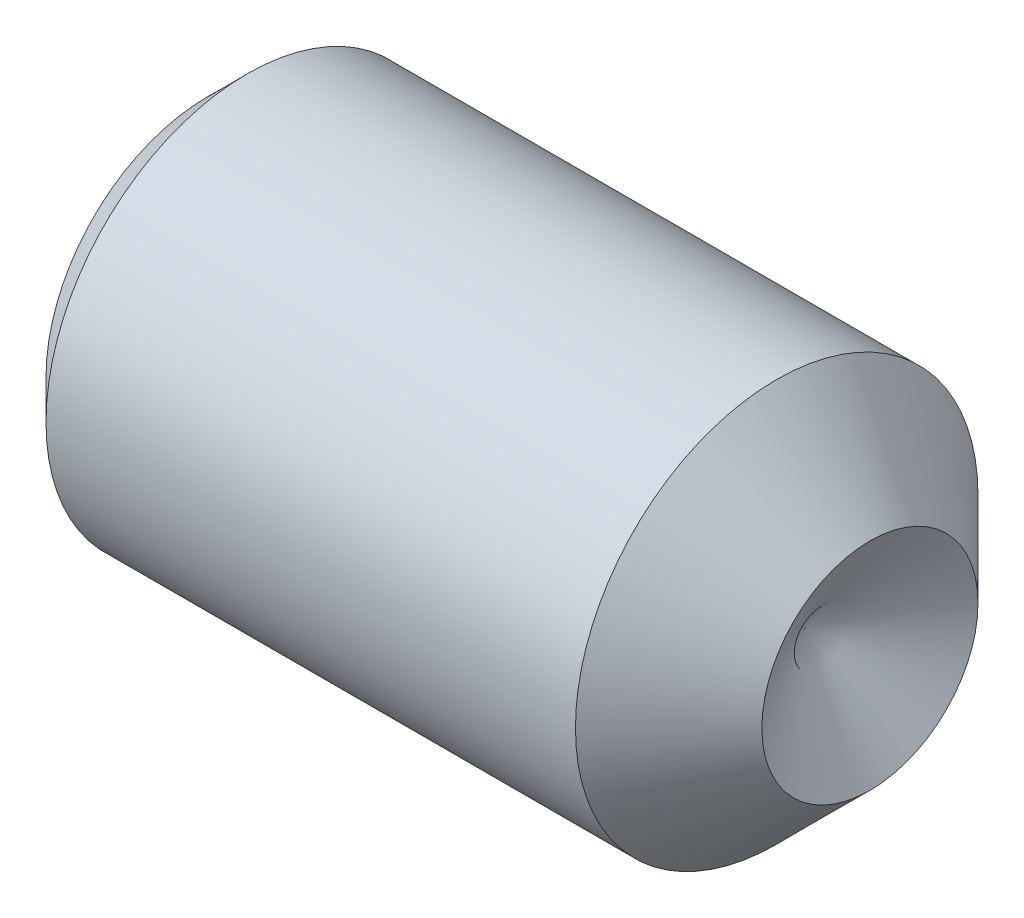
from build123d import *

# Parameters (mm, degrees)
HEX_2_DEPTH = 2.54


with BuildPart() as part:
    # BodySke → BaseBody (revolve)
    with BuildSketch(Plane.XY, mode=Mode.PRIVATE) as basebody_sk:
        Polygon((0, 0), (0, 1.94056), (0.47244, 2.413), (6.8199, 2.413), (7.9375, 1.2954), (7.159145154, 0), align=None)
    revolve(basebody_sk.sketch.rotate(Axis((-12.7, 0, 0), (1, 0, 0)), 90), axis=Axis((-12.7, 0, 0), (1, 0, 0)))

    # Sketch2 → Hex 2 (cut)
    with BuildSketch(Plane.ZY):
        Polygon((0.687041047, 1.18999), (-0.687041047, 1.18999), (-1.374082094, 0), (-0.687041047, -1.18999), (0.687041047, -1.18999), (1.374082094, 0), align=None)
    extrude(amount=-HEX_2_DEPTH, mode=Mode.SUBTRACT)


solid = part.part
